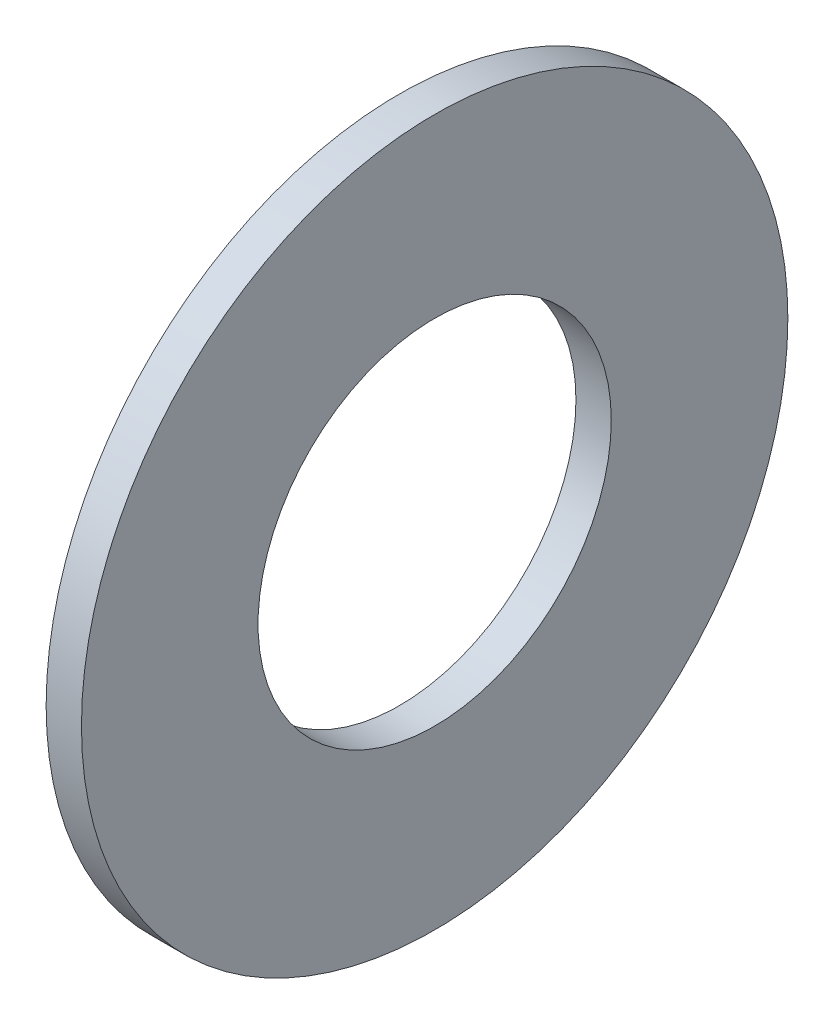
ISO-10303-21;
HEADER;
FILE_DESCRIPTION(('STEP AP214'),'2;1');
FILE_NAME('part.step','',(''),(''),'','','');
FILE_SCHEMA(('AUTOMOTIVE_DESIGN { 1 0 10303 214 1 1 1 1 }'));
ENDSEC;
DATA;
#1=APPLICATION_CONTEXT('core data for automotive mechanical design processes');
#2=APPLICATION_PROTOCOL_DEFINITION('international standard','automotive_design',2000,#1);
#3=PRODUCT_CONTEXT('',#1,'mechanical');
#4=PRODUCT('Part','Part','',(#3));
#5=PRODUCT_RELATED_PRODUCT_CATEGORY('part','',(#4));
#6=PRODUCT_DEFINITION_FORMATION('','',#4);
#7=PRODUCT_DEFINITION_CONTEXT('part definition',#1,'design');
#8=PRODUCT_DEFINITION('design','',#6,#7);
#9=PRODUCT_DEFINITION_SHAPE('','',#8);
#10=(LENGTH_UNIT() NAMED_UNIT(*) SI_UNIT(.MILLI.,.METRE.));
#11=(NAMED_UNIT(*) PLANE_ANGLE_UNIT() SI_UNIT($,.RADIAN.));
#12=(NAMED_UNIT(*) SI_UNIT($,.STERADIAN.) SOLID_ANGLE_UNIT());
#13=UNCERTAINTY_MEASURE_WITH_UNIT(LENGTH_MEASURE(1.E-05),#10,'distance_accuracy_value','');
#14=(GEOMETRIC_REPRESENTATION_CONTEXT(3) GLOBAL_UNCERTAINTY_ASSIGNED_CONTEXT((#13)) GLOBAL_UNIT_ASSIGNED_CONTEXT((#10,
#11,#12)) REPRESENTATION_CONTEXT('',''));
#15=CARTESIAN_POINT('',(0.,0.,0.));
#16=DIRECTION('',(0.,0.,1.));
#17=DIRECTION('',(1.,0.,0.));
#18=AXIS2_PLACEMENT_3D('',#15,#16,#17);
#19=CARTESIAN_POINT('',(0.5,0.,0.));
#20=DIRECTION('',(1.,0.,0.));
#21=DIRECTION('',(0.,0.,-1.));
#22=AXIS2_PLACEMENT_3D('',#19,#20,#21);
#23=PLANE('',#22);
#24=CARTESIAN_POINT('',(0.5,0.,0.));
#25=DIRECTION('',(1.,0.,0.));
#26=DIRECTION('',(0.,0.,-1.));
#27=AXIS2_PLACEMENT_3D('',#24,#25,#26);
#28=CIRCLE('',#27,5.);
#29=CARTESIAN_POINT('',(0.5,0.,-5.));
#30=VERTEX_POINT('',#29);
#31=EDGE_CURVE('E10',#30,#30,#28,.T.);
#32=ORIENTED_EDGE('',*,*,#31,.T.);
#33=EDGE_LOOP('',(#32));
#34=FACE_BOUND('',#33,.T.);
#35=CARTESIAN_POINT('',(0.5,0.,0.));
#36=DIRECTION('',(1.,0.,0.));
#37=DIRECTION('',(0.,0.,-1.));
#38=AXIS2_PLACEMENT_3D('',#35,#36,#37);
#39=CIRCLE('',#38,2.5);
#40=CARTESIAN_POINT('',(0.5,0.,-2.5));
#41=VERTEX_POINT('',#40);
#42=EDGE_CURVE('E41',#41,#41,#39,.T.);
#43=ORIENTED_EDGE('',*,*,#42,.F.);
#44=EDGE_LOOP('',(#43));
#45=FACE_BOUND('',#44,.T.);
#46=ADVANCED_FACE('F30',(#34,#45),#23,.T.);
#47=CARTESIAN_POINT('',(0.,0.,0.));
#48=DIRECTION('',(1.,0.,0.));
#49=DIRECTION('',(0.,0.,-1.));
#50=AXIS2_PLACEMENT_3D('',#47,#48,#49);
#51=PLANE('',#50);
#52=CARTESIAN_POINT('',(0.,0.,0.));
#53=DIRECTION('',(1.,0.,0.));
#54=DIRECTION('',(0.,0.,-1.));
#55=AXIS2_PLACEMENT_3D('',#52,#53,#54);
#56=CIRCLE('',#55,5.);
#57=CARTESIAN_POINT('',(0.,0.,-5.));
#58=VERTEX_POINT('',#57);
#59=EDGE_CURVE('E34',#58,#58,#56,.T.);
#60=ORIENTED_EDGE('',*,*,#59,.F.);
#61=EDGE_LOOP('',(#60));
#62=FACE_BOUND('',#61,.T.);
#63=CARTESIAN_POINT('',(0.,0.,0.));
#64=DIRECTION('',(1.,0.,0.));
#65=DIRECTION('',(0.,0.,-1.));
#66=AXIS2_PLACEMENT_3D('',#63,#64,#65);
#67=CIRCLE('',#66,2.5);
#68=CARTESIAN_POINT('',(0.,0.,-2.5));
#69=VERTEX_POINT('',#68);
#70=EDGE_CURVE('E43',#69,#69,#67,.T.);
#71=ORIENTED_EDGE('',*,*,#70,.T.);
#72=EDGE_LOOP('',(#71));
#73=FACE_BOUND('',#72,.T.);
#74=ADVANCED_FACE('F53',(#62,#73),#51,.F.);
#75=CARTESIAN_POINT('',(0.5,0.,0.));
#76=DIRECTION('',(-1.,0.,0.));
#77=DIRECTION('',(0.,0.,1.));
#78=AXIS2_PLACEMENT_3D('',#75,#76,#77);
#79=CYLINDRICAL_SURFACE('',#78,5.);
#80=ORIENTED_EDGE('',*,*,#31,.F.);
#81=EDGE_LOOP('',(#80));
#82=FACE_BOUND('',#81,.T.);
#83=ORIENTED_EDGE('',*,*,#59,.T.);
#84=EDGE_LOOP('',(#83));
#85=FACE_BOUND('',#84,.T.);
#86=ADVANCED_FACE('F32',(#82,#85),#79,.T.);
#87=CARTESIAN_POINT('',(0.5,0.,0.));
#88=DIRECTION('',(-1.,0.,0.));
#89=DIRECTION('',(0.,0.,1.));
#90=AXIS2_PLACEMENT_3D('',#87,#88,#89);
#91=CYLINDRICAL_SURFACE('',#90,2.5);
#92=ORIENTED_EDGE('',*,*,#42,.T.);
#93=EDGE_LOOP('',(#92));
#94=FACE_BOUND('',#93,.T.);
#95=ORIENTED_EDGE('',*,*,#70,.F.);
#96=EDGE_LOOP('',(#95));
#97=FACE_BOUND('',#96,.T.);
#98=ADVANCED_FACE('F49',(#94,#97),#91,.F.);
#99=CLOSED_SHELL('',(#46,#74,#86,#98));
#100=MANIFOLD_SOLID_BREP('B2',#99);
#101=ADVANCED_BREP_SHAPE_REPRESENTATION('',(#18,#100),#14);
#102=SHAPE_DEFINITION_REPRESENTATION(#9,#101);
ENDSEC;
END-ISO-10303-21;
